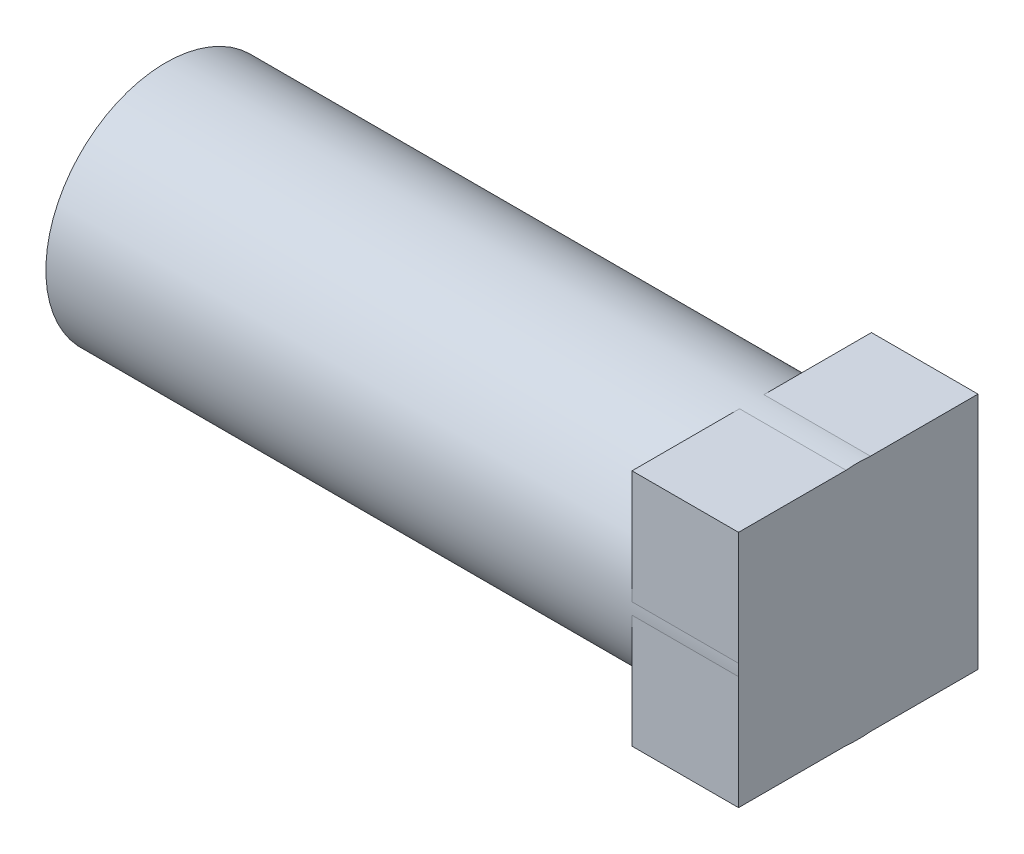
from build123d import *

# Parameters (mm, degrees)
SKETCH1_R           = 2.25
BOSS_EXTRUDE1_DEPTH = 13
SKETCH2_W           = 4.494767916
SKETCH2_H           = 4.476575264
BOSS_EXTRUDE2_DEPTH = 2


with BuildPart() as part:
    # Sketch1 → Boss-Extrude1 (new body)
    with BuildSketch(Plane(origin=(0, 0, 0), x_dir=(0, 0, -1), z_dir=(1, 0, 0))):
        with Locations(Location((0, 0, 0), (0, 0, 180))):
            Circle(SKETCH1_R)
    extrude(amount=BOSS_EXTRUDE1_DEPTH)

    # Sketch2 → Boss-Extrude2 (add)
    with BuildSketch(Plane(origin=(13, 0, 0), x_dir=(0, 0, -1), z_dir=(1, 0, 0))):
        Rectangle(SKETCH2_W, SKETCH2_H)
    extrude(amount=-BOSS_EXTRUDE2_DEPTH)


solid = part.part
